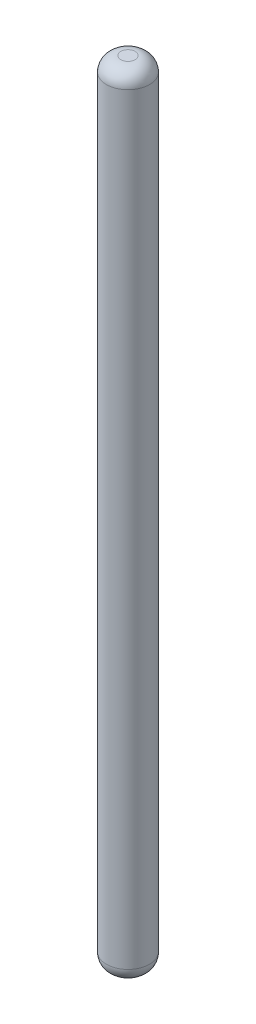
ISO-10303-21;
HEADER;
FILE_DESCRIPTION(('STEP AP214'),'2;1');
FILE_NAME('part.step','',(''),(''),'','','');
FILE_SCHEMA(('AUTOMOTIVE_DESIGN { 1 0 10303 214 1 1 1 1 }'));
ENDSEC;
DATA;
#1=APPLICATION_CONTEXT('core data for automotive mechanical design processes');
#2=APPLICATION_PROTOCOL_DEFINITION('international standard','automotive_design',2000,#1);
#3=PRODUCT_CONTEXT('',#1,'mechanical');
#4=PRODUCT('Part','Part','',(#3));
#5=PRODUCT_RELATED_PRODUCT_CATEGORY('part','',(#4));
#6=PRODUCT_DEFINITION_FORMATION('','',#4);
#7=PRODUCT_DEFINITION_CONTEXT('part definition',#1,'design');
#8=PRODUCT_DEFINITION('design','',#6,#7);
#9=PRODUCT_DEFINITION_SHAPE('','',#8);
#10=(LENGTH_UNIT() NAMED_UNIT(*) SI_UNIT(.MILLI.,.METRE.));
#11=(NAMED_UNIT(*) PLANE_ANGLE_UNIT() SI_UNIT($,.RADIAN.));
#12=(NAMED_UNIT(*) SI_UNIT($,.STERADIAN.) SOLID_ANGLE_UNIT());
#13=UNCERTAINTY_MEASURE_WITH_UNIT(LENGTH_MEASURE(1.E-05),#10,'distance_accuracy_value','');
#14=(GEOMETRIC_REPRESENTATION_CONTEXT(3) GLOBAL_UNCERTAINTY_ASSIGNED_CONTEXT((#13)) GLOBAL_UNIT_ASSIGNED_CONTEXT((#10,
#11,#12)) REPRESENTATION_CONTEXT('',''));
#15=CARTESIAN_POINT('',(0.,0.,0.));
#16=DIRECTION('',(0.,0.,1.));
#17=DIRECTION('',(1.,0.,0.));
#18=AXIS2_PLACEMENT_3D('',#15,#16,#17);
#19=CARTESIAN_POINT('',(0.,55.,0.));
#20=DIRECTION('',(0.,-1.,0.));
#21=DIRECTION('',(0.,0.,-1.));
#22=AXIS2_PLACEMENT_3D('',#19,#20,#21);
#23=CYLINDRICAL_SURFACE('',#22,1.5);
#24=CARTESIAN_POINT('',(0.,1.,0.));
#25=DIRECTION('',(0.,1.,0.));
#26=DIRECTION('',(0.,0.,1.));
#27=AXIS2_PLACEMENT_3D('',#24,#25,#26);
#28=CIRCLE('',#27,1.5);
#29=CARTESIAN_POINT('',(0.,1.,1.5));
#30=VERTEX_POINT('',#29);
#31=EDGE_CURVE('E50',#30,#30,#28,.T.);
#32=ORIENTED_EDGE('',*,*,#31,.T.);
#33=EDGE_LOOP('',(#32));
#34=FACE_BOUND('',#33,.T.);
#35=CARTESIAN_POINT('',(0.,54.,0.));
#36=DIRECTION('',(0.,1.,0.));
#37=DIRECTION('',(0.,0.,1.));
#38=AXIS2_PLACEMENT_3D('',#35,#36,#37);
#39=CIRCLE('',#38,1.5);
#40=CARTESIAN_POINT('',(0.,54.,1.5));
#41=VERTEX_POINT('',#40);
#42=EDGE_CURVE('E55',#41,#41,#39,.F.);
#43=ORIENTED_EDGE('',*,*,#42,.T.);
#44=EDGE_LOOP('',(#43));
#45=FACE_BOUND('',#44,.T.);
#46=ADVANCED_FACE('F37',(#34,#45),#23,.T.);
#47=CARTESIAN_POINT('',(0.,55.,0.));
#48=DIRECTION('',(0.,1.,0.));
#49=DIRECTION('',(0.,0.,1.));
#50=AXIS2_PLACEMENT_3D('',#47,#48,#49);
#51=PLANE('',#50);
#52=CARTESIAN_POINT('',(0.,55.,0.));
#53=DIRECTION('',(0.,1.,0.));
#54=DIRECTION('',(0.,0.,1.));
#55=AXIS2_PLACEMENT_3D('',#52,#53,#54);
#56=CIRCLE('',#55,0.5);
#57=CARTESIAN_POINT('',(0.,55.,0.5));
#58=VERTEX_POINT('',#57);
#59=EDGE_CURVE('E10',#58,#58,#56,.T.);
#60=ORIENTED_EDGE('',*,*,#59,.T.);
#61=EDGE_LOOP('',(#60));
#62=FACE_BOUND('',#61,.T.);
#63=ADVANCED_FACE('F72',(#62),#51,.T.);
#64=CARTESIAN_POINT('',(0.,0.,0.));
#65=DIRECTION('',(0.,1.,0.));
#66=DIRECTION('',(0.,0.,1.));
#67=AXIS2_PLACEMENT_3D('',#64,#65,#66);
#68=PLANE('',#67);
#69=CARTESIAN_POINT('',(0.,0.,0.));
#70=DIRECTION('',(0.,1.,0.));
#71=DIRECTION('',(0.,0.,1.));
#72=AXIS2_PLACEMENT_3D('',#69,#70,#71);
#73=CIRCLE('',#72,0.5);
#74=CARTESIAN_POINT('',(0.,0.,0.5));
#75=VERTEX_POINT('',#74);
#76=EDGE_CURVE('E45',#75,#75,#73,.F.);
#77=ORIENTED_EDGE('',*,*,#76,.T.);
#78=EDGE_LOOP('',(#77));
#79=FACE_BOUND('',#78,.T.);
#80=ADVANCED_FACE('F69',(#79),#68,.F.);
#81=CARTESIAN_POINT('',(0.,1.,0.));
#82=DIRECTION('',(0.,1.,0.));
#83=DIRECTION('',(0.,0.,1.));
#84=AXIS2_PLACEMENT_3D('',#81,#82,#83);
#85=DEGENERATE_TOROIDAL_SURFACE('',#84,0.5,1.,.T.);
#86=ORIENTED_EDGE('',*,*,#76,.F.);
#87=EDGE_LOOP('',(#86));
#88=FACE_BOUND('',#87,.T.);
#89=ORIENTED_EDGE('',*,*,#31,.F.);
#90=EDGE_LOOP('',(#89));
#91=FACE_BOUND('',#90,.T.);
#92=ADVANCED_FACE('F65',(#88,#91),#85,.T.);
#93=CARTESIAN_POINT('',(0.,54.,0.));
#94=DIRECTION('',(0.,1.,0.));
#95=DIRECTION('',(0.,0.,1.));
#96=AXIS2_PLACEMENT_3D('',#93,#94,#95);
#97=DEGENERATE_TOROIDAL_SURFACE('',#96,0.5,1.,.T.);
#98=ORIENTED_EDGE('',*,*,#42,.F.);
#99=EDGE_LOOP('',(#98));
#100=FACE_BOUND('',#99,.T.);
#101=ORIENTED_EDGE('',*,*,#59,.F.);
#102=EDGE_LOOP('',(#101));
#103=FACE_BOUND('',#102,.T.);
#104=ADVANCED_FACE('F39',(#100,#103),#97,.T.);
#105=CLOSED_SHELL('',(#46,#63,#80,#92,#104));
#106=MANIFOLD_SOLID_BREP('B2',#105);
#107=ADVANCED_BREP_SHAPE_REPRESENTATION('',(#18,#106),#14);
#108=SHAPE_DEFINITION_REPRESENTATION(#9,#107);
ENDSEC;
END-ISO-10303-21;
